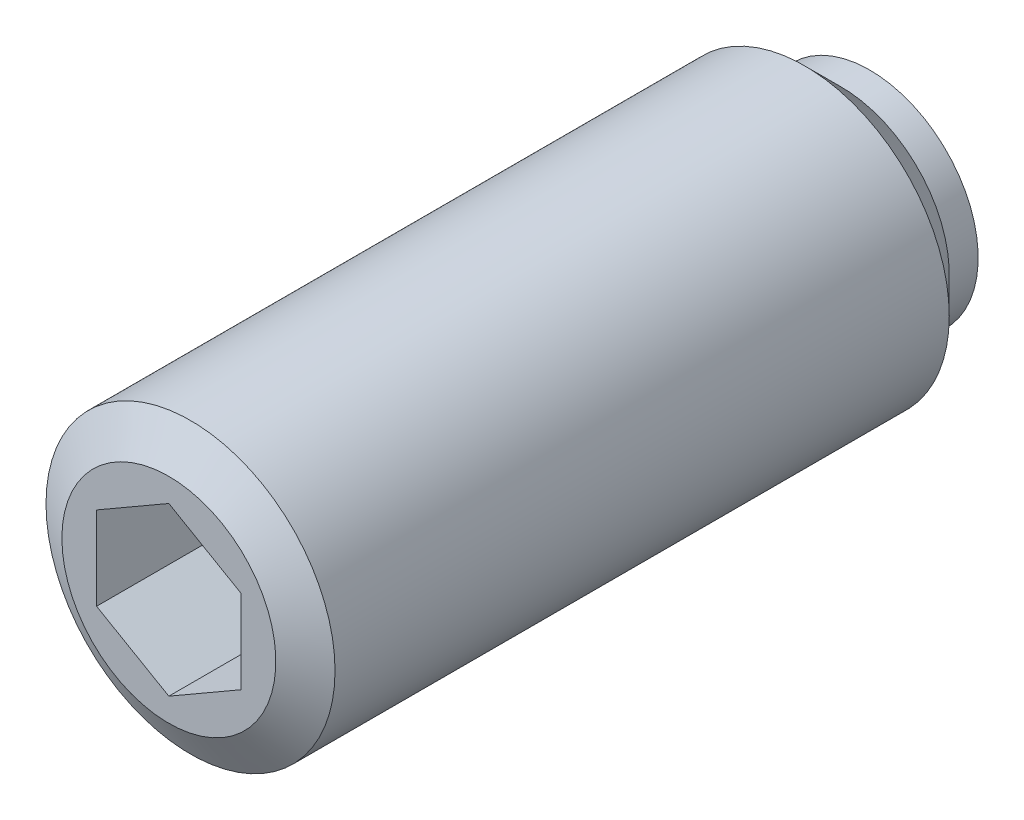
ISO-10303-21;
HEADER;
FILE_DESCRIPTION(('STEP AP214'),'2;1');
FILE_NAME('part.step','',(''),(''),'','','');
FILE_SCHEMA(('AUTOMOTIVE_DESIGN { 1 0 10303 214 1 1 1 1 }'));
ENDSEC;
DATA;
#1=APPLICATION_CONTEXT('core data for automotive mechanical design processes');
#2=APPLICATION_PROTOCOL_DEFINITION('international standard','automotive_design',2000,#1);
#3=PRODUCT_CONTEXT('',#1,'mechanical');
#4=PRODUCT('Part','Part','',(#3));
#5=PRODUCT_RELATED_PRODUCT_CATEGORY('part','',(#4));
#6=PRODUCT_DEFINITION_FORMATION('','',#4);
#7=PRODUCT_DEFINITION_CONTEXT('part definition',#1,'design');
#8=PRODUCT_DEFINITION('design','',#6,#7);
#9=PRODUCT_DEFINITION_SHAPE('','',#8);
#10=(LENGTH_UNIT() NAMED_UNIT(*) SI_UNIT(.MILLI.,.METRE.));
#11=(NAMED_UNIT(*) PLANE_ANGLE_UNIT() SI_UNIT($,.RADIAN.));
#12=(NAMED_UNIT(*) SI_UNIT($,.STERADIAN.) SOLID_ANGLE_UNIT());
#13=UNCERTAINTY_MEASURE_WITH_UNIT(LENGTH_MEASURE(1.E-05),#10,'distance_accuracy_value','');
#14=(GEOMETRIC_REPRESENTATION_CONTEXT(3) GLOBAL_UNCERTAINTY_ASSIGNED_CONTEXT((#13)) GLOBAL_UNIT_ASSIGNED_CONTEXT((#10,
#11,#12)) REPRESENTATION_CONTEXT('',''));
#15=CARTESIAN_POINT('',(0.,0.,0.));
#16=DIRECTION('',(0.,0.,1.));
#17=DIRECTION('',(1.,0.,0.));
#18=AXIS2_PLACEMENT_3D('',#15,#16,#17);
#19=CARTESIAN_POINT('',(0.,0.940733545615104,0.));
#20=DIRECTION('',(0.,0.,1.));
#21=DIRECTION('',(-1.,0.,0.));
#22=AXIS2_PLACEMENT_3D('',#19,#20,#21);
#23=PLANE('',#22);
#24=CARTESIAN_POINT('',(0.,0.,0.));
#25=DIRECTION('',(0.,0.,1.));
#26=DIRECTION('',(-1.,0.,0.));
#27=AXIS2_PLACEMENT_3D('',#24,#25,#26);
#28=CIRCLE('',#27,0.940733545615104);
#29=CARTESIAN_POINT('',(0.,0.9407335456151,0.));
#30=VERTEX_POINT('',#29);
#31=EDGE_CURVE('E9',#30,#30,#28,.T.);
#32=ORIENTED_EDGE('',*,*,#31,.F.);
#33=EDGE_LOOP('',(#32));
#34=FACE_BOUND('',#33,.T.);
#35=ADVANCED_FACE('F14',(#34),#23,.F.);
#36=CARTESIAN_POINT('',(0.,0.,0.823116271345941));
#37=DIRECTION('',(0.,0.,1.));
#38=DIRECTION('',(0.,1.,0.));
#39=AXIS2_PLACEMENT_3D('',#36,#37,#38);
#40=SPHERICAL_SURFACE('',#39,1.25);
#41=CARTESIAN_POINT('',(0.,0.,0.2));
#42=DIRECTION('',(0.,0.,1.));
#43=DIRECTION('',(-1.,0.,0.));
#44=AXIS2_PLACEMENT_3D('',#41,#42,#43);
#45=CIRCLE('',#44,1.0836171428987);
#46=CARTESIAN_POINT('',(0.,1.0836171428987,0.2));
#47=VERTEX_POINT('',#46);
#48=EDGE_CURVE('E21',#47,#47,#45,.T.);
#49=CARTESIAN_POINT('',(0.,1.0836171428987,0.2));
#50=CARTESIAN_POINT('',(0.,1.08233874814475,0.197776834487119));
#51=CARTESIAN_POINT('',(0.,1.08105351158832,0.1955576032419));
#52=CARTESIAN_POINT('',(0.,1.0784694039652,0.191127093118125));
#53=CARTESIAN_POINT('',(0.,1.0771705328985,0.188915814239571));
#54=CARTESIAN_POINT('',(0.,1.07455920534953,0.184501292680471));
#55=CARTESIAN_POINT('',(0.,1.07324674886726,0.182298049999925));
#56=CARTESIAN_POINT('',(0.,1.07060830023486,0.177899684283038));
#57=CARTESIAN_POINT('',(0.,1.06928230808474,0.175704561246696));
#58=CARTESIAN_POINT('',(0.,1.06661683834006,0.171322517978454));
#59=CARTESIAN_POINT('',(0.,1.0652773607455,0.169135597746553));
#60=CARTESIAN_POINT('',(0.,1.06258497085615,0.164770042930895));
#61=CARTESIAN_POINT('',(0.,1.06123205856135,0.162591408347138));
#62=CARTESIAN_POINT('',(0.,1.05851285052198,0.158242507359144));
#63=CARTESIAN_POINT('',(0.,1.05714655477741,0.156072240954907));
#64=CARTESIAN_POINT('',(0.,1.05440063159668,0.151740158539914));
#65=CARTESIAN_POINT('',(0.,1.05302100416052,0.149578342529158));
#66=CARTESIAN_POINT('',(0.,1.05024846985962,0.145263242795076));
#67=CARTESIAN_POINT('',(0.,1.04885556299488,0.143109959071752));
#68=CARTESIAN_POINT('',(0.,1.04605652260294,0.138812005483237));
#69=CARTESIAN_POINT('',(0.,1.04465038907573,0.136667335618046));
#70=CARTESIAN_POINT('',(0.,1.04182494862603,0.132386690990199));
#71=CARTESIAN_POINT('',(0.,1.04040564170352,0.130250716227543));
#72=CARTESIAN_POINT('',(0.,1.0375539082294,0.125987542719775));
#73=CARTESIAN_POINT('',(0.,1.03612148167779,0.123860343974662));
#74=CARTESIAN_POINT('',(0.,1.03324356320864,0.119614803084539));
#75=CARTESIAN_POINT('',(0.,1.03179807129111,0.117496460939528));
#76=CARTESIAN_POINT('',(0.,1.02889407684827,0.113268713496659));
#77=CARTESIAN_POINT('',(0.,1.02743557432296,0.1111593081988));
#78=CARTESIAN_POINT('',(0.,1.02450561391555,0.106949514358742));
#79=CARTESIAN_POINT('',(0.,1.02303415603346,0.104849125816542));
#80=CARTESIAN_POINT('',(0.,1.02007834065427,0.100657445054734));
#81=CARTESIAN_POINT('',(0.,1.01859398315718,0.0985661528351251));
#82=CARTESIAN_POINT('',(0.,1.01561242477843,0.094392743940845));
#83=CARTESIAN_POINT('',(0.,1.01411522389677,0.0923106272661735));
#84=CARTESIAN_POINT('',(0.,1.01110803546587,0.0881556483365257));
#85=CARTESIAN_POINT('',(0.,1.00959804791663,0.0860827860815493));
#86=CARTESIAN_POINT('',(0.,1.00656534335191,0.0819463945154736));
#87=CARTESIAN_POINT('',(0.,1.00504262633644,0.0798828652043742));
#88=CARTESIAN_POINT('',(0.,1.00198452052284,0.0757652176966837));
#89=CARTESIAN_POINT('',(0.,1.00044913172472,0.0737110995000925));
#90=CARTESIAN_POINT('',(0.,0.99736574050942,0.0696123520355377));
#91=CARTESIAN_POINT('',(0.,0.995817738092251,0.0675677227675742));
#92=CARTESIAN_POINT('',(0.,0.992709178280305,0.0634880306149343));
#93=CARTESIAN_POINT('',(0.,0.99114862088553,0.061452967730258));
#94=CARTESIAN_POINT('',(0.,0.988015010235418,0.0573924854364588));
#95=CARTESIAN_POINT('',(0.,0.986441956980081,0.055367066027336));
#96=CARTESIAN_POINT('',(0.,0.983283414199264,0.0513259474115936));
#97=CARTESIAN_POINT('',(0.,0.981697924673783,0.049310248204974));
#98=CARTESIAN_POINT('',(0.,0.978514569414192,0.0452886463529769));
#99=CARTESIAN_POINT('',(0.,0.976916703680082,0.0432827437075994));
#100=CARTESIAN_POINT('',(0.,0.973708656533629,0.0392808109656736));
#101=CARTESIAN_POINT('',(0.,0.972098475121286,0.0372847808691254));
#102=CARTESIAN_POINT('',(0.,0.968865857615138,0.0333026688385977));
#103=CARTESIAN_POINT('',(0.,0.967243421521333,0.0313165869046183));
#104=CARTESIAN_POINT('',(0.,0.963986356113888,0.0273544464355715));
#105=CARTESIAN_POINT('',(0.,0.962351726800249,0.0253783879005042));
#106=CARTESIAN_POINT('',(0.,0.959070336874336,0.0214363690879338));
#107=CARTESIAN_POINT('',(0.,0.957423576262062,0.0194704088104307));
#108=CARTESIAN_POINT('',(0.,0.95411798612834,0.0155486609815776));
#109=CARTESIAN_POINT('',(0.,0.952459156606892,0.0135928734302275));
#110=CARTESIAN_POINT('',(0.,0.949129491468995,0.00969154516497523));
#111=CARTESIAN_POINT('',(0.,0.947458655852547,0.00774600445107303));
#112=CARTESIAN_POINT('',(0.,0.944105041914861,0.00386524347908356));
#113=CARTESIAN_POINT('',(0.,0.942422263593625,0.00193002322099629));
#114=CARTESIAN_POINT('',(0.,0.9407335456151,0.));
#115=B_SPLINE_CURVE_WITH_KNOTS('',3,(#49,#50,#51,#52,#53,#54,#55,#56,#57,#58,#59,#60,#61,#62,
#63,#64,#65,#66,#67,#68,#69,#70,#71,#72,#73,#74,#75,#76,#77,#78,#79,#80,#81,#82,#83,#84,#85,#86,
#87,#88,#89,#90,#91,#92,#93,#94,#95,#96,#97,#98,#99,#100,#101,#102,#103,#104,#105,#106,#107,
#108,#109,#110,#111,#112,#113,#114),.UNSPECIFIED.,.F.,.F.,(4,2,2,2,2,2,2,2,2,2,2,2,2,2,2,2,2,2,
2,2,2,2,2,2,2,2,2,2,2,2,2,2,4),(0.,0.00769354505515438,0.0153870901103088,0.0230806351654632,
0.0307741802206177,0.0384677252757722,0.0461612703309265,0.0538548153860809,0.0615483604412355,
0.0692419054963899,0.0769354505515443,0.0846289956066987,0.092322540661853,0.100016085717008,
0.107709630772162,0.115403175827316,0.123096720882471,0.130790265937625,0.13848381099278,
0.146177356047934,0.153870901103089,0.161564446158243,0.169257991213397,0.176951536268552,
0.184645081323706,0.192338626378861,0.200032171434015,0.207725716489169,0.215419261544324,
0.223112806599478,0.230806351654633,0.238499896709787,0.246193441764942),.UNSPECIFIED.);
#116=EDGE_CURVE('BSEAM141',#47,#30,#115,.T.);
#117=ORIENTED_EDGE('',*,*,#48,.F.);
#118=ORIENTED_EDGE('',*,*,#31,.T.);
#119=ORIENTED_EDGE('',*,*,#116,.T.);
#120=ORIENTED_EDGE('',*,*,#116,.F.);
#121=EDGE_LOOP('',(#117,#119,#118,#120));
#122=FACE_BOUND('',#121,.T.);
#123=ADVANCED_FACE('F141',(#122),#40,.T.);
#124=CARTESIAN_POINT('',(0.,1.5,0.2));
#125=DIRECTION('',(0.,0.,1.));
#126=DIRECTION('',(-1.,0.,0.));
#127=AXIS2_PLACEMENT_3D('',#124,#125,#126);
#128=PLANE('',#127);
#129=CARTESIAN_POINT('',(0.,0.,0.2));
#130=DIRECTION('',(0.,0.,1.));
#131=DIRECTION('',(-1.,0.,0.));
#132=AXIS2_PLACEMENT_3D('',#129,#130,#131);
#133=CIRCLE('',#132,1.5);
#134=CARTESIAN_POINT('',(-1.5,0.,0.2));
#135=VERTEX_POINT('',#134);
#136=EDGE_CURVE('E134',#135,#135,#133,.T.);
#137=ORIENTED_EDGE('',*,*,#136,.F.);
#138=EDGE_LOOP('',(#137));
#139=FACE_BOUND('',#138,.T.);
#140=ORIENTED_EDGE('',*,*,#48,.T.);
#141=EDGE_LOOP('',(#140));
#142=FACE_BOUND('',#141,.T.);
#143=ADVANCED_FACE('F139',(#139,#142),#128,.F.);
#144=CARTESIAN_POINT('',(0.,0.,11.2950749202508));
#145=DIRECTION('',(0.,0.,1.));
#146=DIRECTION('',(-1.,0.,0.));
#147=AXIS2_PLACEMENT_3D('',#144,#145,#146);
#148=CYLINDRICAL_SURFACE('',#147,1.5);
#149=CARTESIAN_POINT('',(0.,0.,0.6));
#150=DIRECTION('',(0.,0.,1.));
#151=DIRECTION('',(-1.,0.,0.));
#152=AXIS2_PLACEMENT_3D('',#149,#150,#151);
#153=CIRCLE('',#152,1.5);
#154=CARTESIAN_POINT('',(-1.5,0.,0.6));
#155=VERTEX_POINT('',#154);
#156=EDGE_CURVE('E131',#155,#155,#153,.T.);
#157=ORIENTED_EDGE('',*,*,#156,.F.);
#158=EDGE_LOOP('',(#157));
#159=FACE_BOUND('',#158,.T.);
#160=ORIENTED_EDGE('',*,*,#136,.T.);
#161=EDGE_LOOP('',(#160));
#162=FACE_BOUND('',#161,.T.);
#163=ADVANCED_FACE('F164',(#159,#162),#148,.T.);
#164=CARTESIAN_POINT('',(0.,0.,0.6));
#165=DIRECTION('',(0.,0.,1.));
#166=DIRECTION('',(-1.,0.,0.));
#167=AXIS2_PLACEMENT_3D('',#164,#165,#166);
#168=CONICAL_SURFACE('',#167,1.5,0.785398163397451);
#169=CARTESIAN_POINT('',(0.,0.,1.1));
#170=DIRECTION('',(0.,0.,1.));
#171=DIRECTION('',(-1.,0.,0.));
#172=AXIS2_PLACEMENT_3D('',#169,#170,#171);
#173=CIRCLE('',#172,2.);
#174=CARTESIAN_POINT('',(-2.,0.,1.1));
#175=VERTEX_POINT('',#174);
#176=EDGE_CURVE('E128',#175,#175,#173,.T.);
#177=ORIENTED_EDGE('',*,*,#176,.F.);
#178=EDGE_LOOP('',(#177));
#179=FACE_BOUND('',#178,.T.);
#180=ORIENTED_EDGE('',*,*,#156,.T.);
#181=EDGE_LOOP('',(#180));
#182=FACE_BOUND('',#181,.T.);
#183=ADVANCED_FACE('F173',(#179,#182),#168,.T.);
#184=CARTESIAN_POINT('',(0.,0.,11.2950749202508));
#185=DIRECTION('',(0.,0.,1.));
#186=DIRECTION('',(-1.,0.,0.));
#187=AXIS2_PLACEMENT_3D('',#184,#185,#186);
#188=CYLINDRICAL_SURFACE('',#187,2.);
#189=CARTESIAN_POINT('',(0.,0.,9.6));
#190=DIRECTION('',(0.,0.,1.));
#191=DIRECTION('',(-1.,0.,0.));
#192=AXIS2_PLACEMENT_3D('',#189,#190,#191);
#193=CIRCLE('',#192,2.);
#194=CARTESIAN_POINT('',(-2.,0.,9.6));
#195=VERTEX_POINT('',#194);
#196=EDGE_CURVE('E125',#195,#195,#193,.T.);
#197=ORIENTED_EDGE('',*,*,#196,.F.);
#198=EDGE_LOOP('',(#197));
#199=FACE_BOUND('',#198,.T.);
#200=ORIENTED_EDGE('',*,*,#176,.T.);
#201=EDGE_LOOP('',(#200));
#202=FACE_BOUND('',#201,.T.);
#203=ADVANCED_FACE('F182',(#199,#202),#188,.T.);
#204=CARTESIAN_POINT('',(0.,0.,9.6));
#205=DIRECTION('',(0.,0.,-1.));
#206=DIRECTION('',(1.,0.,0.));
#207=AXIS2_PLACEMENT_3D('',#204,#205,#206);
#208=CONICAL_SURFACE('',#207,2.,1.04719755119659);
#209=CARTESIAN_POINT('',(0.,0.,9.9));
#210=DIRECTION('',(0.,0.,1.));
#211=DIRECTION('',(-1.,0.,0.));
#212=AXIS2_PLACEMENT_3D('',#209,#210,#211);
#213=CIRCLE('',#212,1.48038475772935);
#214=CARTESIAN_POINT('',(-1.48038475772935,0.,9.9));
#215=VERTEX_POINT('',#214);
#216=EDGE_CURVE('E116',#215,#215,#213,.T.);
#217=ORIENTED_EDGE('',*,*,#216,.F.);
#218=EDGE_LOOP('',(#217));
#219=FACE_BOUND('',#218,.T.);
#220=ORIENTED_EDGE('',*,*,#196,.T.);
#221=EDGE_LOOP('',(#220));
#222=FACE_BOUND('',#221,.T.);
#223=ADVANCED_FACE('F191',(#219,#222),#208,.T.);
#224=CARTESIAN_POINT('',(0.,0.,9.9));
#225=DIRECTION('',(0.,0.,-1.));
#226=DIRECTION('',(1.,0.,0.));
#227=AXIS2_PLACEMENT_3D('',#224,#225,#226);
#228=PLANE('',#227);
#229=DIRECTION('',(-0.866025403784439,-0.5,0.));
#230=VECTOR('',#229,1.);
#231=CARTESIAN_POINT('',(0.,1.15470053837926,9.9));
#232=LINE('',#231,#230);
#233=CARTESIAN_POINT('',(0.,1.15470053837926,9.9));
#234=VERTEX_POINT('',#233);
#235=CARTESIAN_POINT('',(-1.,0.577350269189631,9.9));
#236=VERTEX_POINT('',#235);
#237=EDGE_CURVE('E82',#234,#236,#232,.T.);
#238=ORIENTED_EDGE('',*,*,#237,.F.);
#239=DIRECTION('',(-0.866025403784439,0.5,0.));
#240=VECTOR('',#239,1.);
#241=CARTESIAN_POINT('',(1.,0.577350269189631,9.9));
#242=LINE('',#241,#240);
#243=CARTESIAN_POINT('',(1.,0.577350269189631,9.9));
#244=VERTEX_POINT('',#243);
#245=EDGE_CURVE('E28',#244,#234,#242,.T.);
#246=ORIENTED_EDGE('',*,*,#245,.F.);
#247=DIRECTION('',(0.,1.,0.));
#248=VECTOR('',#247,1.);
#249=CARTESIAN_POINT('',(1.,-0.577350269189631,9.9));
#250=LINE('',#249,#248);
#251=CARTESIAN_POINT('',(1.,-0.577350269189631,9.9));
#252=VERTEX_POINT('',#251);
#253=EDGE_CURVE('E98',#252,#244,#250,.T.);
#254=ORIENTED_EDGE('',*,*,#253,.F.);
#255=DIRECTION('',(0.866025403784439,0.5,0.));
#256=VECTOR('',#255,1.);
#257=CARTESIAN_POINT('',(0.,-1.15470053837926,9.9));
#258=LINE('',#257,#256);
#259=CARTESIAN_POINT('',(0.,-1.15470053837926,9.9));
#260=VERTEX_POINT('',#259);
#261=EDGE_CURVE('E92',#260,#252,#258,.T.);
#262=ORIENTED_EDGE('',*,*,#261,.F.);
#263=DIRECTION('',(0.866025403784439,-0.5,0.));
#264=VECTOR('',#263,1.);
#265=CARTESIAN_POINT('',(-1.,-0.577350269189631,9.9));
#266=LINE('',#265,#264);
#267=CARTESIAN_POINT('',(-1.,-0.577350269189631,9.9));
#268=VERTEX_POINT('',#267);
#269=EDGE_CURVE('E90',#268,#260,#266,.T.);
#270=ORIENTED_EDGE('',*,*,#269,.F.);
#271=DIRECTION('',(0.,-1.,0.));
#272=VECTOR('',#271,1.);
#273=CARTESIAN_POINT('',(-1.,0.577350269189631,9.9));
#274=LINE('',#273,#272);
#275=EDGE_CURVE('E71',#236,#268,#274,.T.);
#276=ORIENTED_EDGE('',*,*,#275,.F.);
#277=EDGE_LOOP('',(#238,#246,#254,#262,#270,#276));
#278=FACE_BOUND('',#277,.T.);
#279=ORIENTED_EDGE('',*,*,#216,.T.);
#280=EDGE_LOOP('',(#279));
#281=FACE_BOUND('',#280,.T.);
#282=ADVANCED_FACE('F86',(#278,#281),#228,.F.);
#283=CARTESIAN_POINT('',(1.,0.577350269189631,7.9));
#284=DIRECTION('',(0.5,0.866025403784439,0.));
#285=DIRECTION('',(0.866025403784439,-0.5,0.));
#286=AXIS2_PLACEMENT_3D('',#283,#284,#285);
#287=PLANE('',#286);
#288=ORIENTED_EDGE('',*,*,#245,.T.);
#289=DIRECTION('',(0.,0.,1.));
#290=VECTOR('',#289,1.);
#291=CARTESIAN_POINT('',(0.,1.15470053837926,7.9));
#292=LINE('',#291,#290);
#293=CARTESIAN_POINT('',(0.,1.15470053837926,7.9));
#294=VERTEX_POINT('',#293);
#295=EDGE_CURVE('E79',#294,#234,#292,.T.);
#296=ORIENTED_EDGE('',*,*,#295,.F.);
#297=DIRECTION('',(-0.866025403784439,0.5,0.));
#298=VECTOR('',#297,1.);
#299=CARTESIAN_POINT('',(1.,0.577350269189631,7.9));
#300=LINE('',#299,#298);
#301=CARTESIAN_POINT('',(1.,0.577350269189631,7.9));
#302=VERTEX_POINT('',#301);
#303=EDGE_CURVE('E100',#302,#294,#300,.T.);
#304=ORIENTED_EDGE('',*,*,#303,.F.);
#305=DIRECTION('',(0.,0.,1.));
#306=VECTOR('',#305,1.);
#307=CARTESIAN_POINT('',(1.,0.577350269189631,7.9));
#308=LINE('',#307,#306);
#309=EDGE_CURVE('E35',#302,#244,#308,.T.);
#310=ORIENTED_EDGE('',*,*,#309,.T.);
#311=EDGE_LOOP('',(#288,#296,#304,#310));
#312=FACE_BOUND('',#311,.T.);
#313=ADVANCED_FACE('F208',(#312),#287,.F.);
#314=CARTESIAN_POINT('',(1.,-0.577350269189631,7.9));
#315=DIRECTION('',(1.,0.,0.));
#316=DIRECTION('',(0.,-1.,0.));
#317=AXIS2_PLACEMENT_3D('',#314,#315,#316);
#318=PLANE('',#317);
#319=ORIENTED_EDGE('',*,*,#253,.T.);
#320=ORIENTED_EDGE('',*,*,#309,.F.);
#321=DIRECTION('',(0.,1.,0.));
#322=VECTOR('',#321,1.);
#323=CARTESIAN_POINT('',(1.,-0.577350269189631,7.9));
#324=LINE('',#323,#322);
#325=CARTESIAN_POINT('',(1.,-0.577350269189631,7.9));
#326=VERTEX_POINT('',#325);
#327=EDGE_CURVE('E112',#326,#302,#324,.T.);
#328=ORIENTED_EDGE('',*,*,#327,.F.);
#329=DIRECTION('',(0.,0.,1.));
#330=VECTOR('',#329,1.);
#331=CARTESIAN_POINT('',(1.,-0.577350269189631,7.9));
#332=LINE('',#331,#330);
#333=EDGE_CURVE('E117',#326,#252,#332,.T.);
#334=ORIENTED_EDGE('',*,*,#333,.T.);
#335=EDGE_LOOP('',(#319,#320,#328,#334));
#336=FACE_BOUND('',#335,.T.);
#337=ADVANCED_FACE('F216',(#336),#318,.F.);
#338=CARTESIAN_POINT('',(0.,-1.15470053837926,7.9));
#339=DIRECTION('',(0.5,-0.866025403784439,0.));
#340=DIRECTION('',(-0.866025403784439,-0.5,0.));
#341=AXIS2_PLACEMENT_3D('',#338,#339,#340);
#342=PLANE('',#341);
#343=ORIENTED_EDGE('',*,*,#261,.T.);
#344=ORIENTED_EDGE('',*,*,#333,.F.);
#345=DIRECTION('',(0.866025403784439,0.5,0.));
#346=VECTOR('',#345,1.);
#347=CARTESIAN_POINT('',(0.,-1.15470053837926,7.9));
#348=LINE('',#347,#346);
#349=CARTESIAN_POINT('',(0.,-1.15470053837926,7.9));
#350=VERTEX_POINT('',#349);
#351=EDGE_CURVE('E109',#350,#326,#348,.T.);
#352=ORIENTED_EDGE('',*,*,#351,.F.);
#353=DIRECTION('',(0.,0.,1.));
#354=VECTOR('',#353,1.);
#355=CARTESIAN_POINT('',(0.,-1.15470053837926,7.9));
#356=LINE('',#355,#354);
#357=EDGE_CURVE('E119',#350,#260,#356,.T.);
#358=ORIENTED_EDGE('',*,*,#357,.T.);
#359=EDGE_LOOP('',(#343,#344,#352,#358));
#360=FACE_BOUND('',#359,.T.);
#361=ADVANCED_FACE('F224',(#360),#342,.F.);
#362=CARTESIAN_POINT('',(-1.,-0.577350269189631,7.9));
#363=DIRECTION('',(-0.5,-0.866025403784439,0.));
#364=DIRECTION('',(-0.866025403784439,0.5,0.));
#365=AXIS2_PLACEMENT_3D('',#362,#363,#364);
#366=PLANE('',#365);
#367=ORIENTED_EDGE('',*,*,#269,.T.);
#368=ORIENTED_EDGE('',*,*,#357,.F.);
#369=DIRECTION('',(0.866025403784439,-0.5,0.));
#370=VECTOR('',#369,1.);
#371=CARTESIAN_POINT('',(-1.,-0.577350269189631,7.9));
#372=LINE('',#371,#370);
#373=CARTESIAN_POINT('',(-1.,-0.577350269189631,7.9));
#374=VERTEX_POINT('',#373);
#375=EDGE_CURVE('E106',#374,#350,#372,.T.);
#376=ORIENTED_EDGE('',*,*,#375,.F.);
#377=DIRECTION('',(0.,0.,1.));
#378=VECTOR('',#377,1.);
#379=CARTESIAN_POINT('',(-1.,-0.577350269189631,7.9));
#380=LINE('',#379,#378);
#381=EDGE_CURVE('E78',#374,#268,#380,.T.);
#382=ORIENTED_EDGE('',*,*,#381,.T.);
#383=EDGE_LOOP('',(#367,#368,#376,#382));
#384=FACE_BOUND('',#383,.T.);
#385=ADVANCED_FACE('F232',(#384),#366,.F.);
#386=CARTESIAN_POINT('',(-1.,0.577350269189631,7.9));
#387=DIRECTION('',(-1.,0.,0.));
#388=DIRECTION('',(0.,0.,-1.));
#389=AXIS2_PLACEMENT_3D('',#386,#387,#388);
#390=PLANE('',#389);
#391=ORIENTED_EDGE('',*,*,#275,.T.);
#392=ORIENTED_EDGE('',*,*,#381,.F.);
#393=DIRECTION('',(0.,-1.,0.));
#394=VECTOR('',#393,1.);
#395=CARTESIAN_POINT('',(-1.,0.577350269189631,7.9));
#396=LINE('',#395,#394);
#397=CARTESIAN_POINT('',(-1.,0.577350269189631,7.9));
#398=VERTEX_POINT('',#397);
#399=EDGE_CURVE('E74',#398,#374,#396,.T.);
#400=ORIENTED_EDGE('',*,*,#399,.F.);
#401=DIRECTION('',(0.,0.,1.));
#402=VECTOR('',#401,1.);
#403=CARTESIAN_POINT('',(-1.,0.577350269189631,7.9));
#404=LINE('',#403,#402);
#405=EDGE_CURVE('E67',#398,#236,#404,.T.);
#406=ORIENTED_EDGE('',*,*,#405,.T.);
#407=EDGE_LOOP('',(#391,#392,#400,#406));
#408=FACE_BOUND('',#407,.T.);
#409=ADVANCED_FACE('F69',(#408),#390,.F.);
#410=CARTESIAN_POINT('',(0.,1.15470053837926,7.9));
#411=DIRECTION('',(-0.5,0.866025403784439,0.));
#412=DIRECTION('',(0.866025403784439,0.5,0.));
#413=AXIS2_PLACEMENT_3D('',#410,#411,#412);
#414=PLANE('',#413);
#415=ORIENTED_EDGE('',*,*,#237,.T.);
#416=ORIENTED_EDGE('',*,*,#405,.F.);
#417=DIRECTION('',(-0.866025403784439,-0.5,0.));
#418=VECTOR('',#417,1.);
#419=CARTESIAN_POINT('',(0.,1.15470053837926,7.9));
#420=LINE('',#419,#418);
#421=EDGE_CURVE('E103',#294,#398,#420,.T.);
#422=ORIENTED_EDGE('',*,*,#421,.F.);
#423=ORIENTED_EDGE('',*,*,#295,.T.);
#424=EDGE_LOOP('',(#415,#416,#422,#423));
#425=FACE_BOUND('',#424,.T.);
#426=ADVANCED_FACE('F83',(#425),#414,.F.);
#427=CARTESIAN_POINT('',(2.,0.,7.9));
#428=DIRECTION('',(0.,0.,-1.));
#429=DIRECTION('',(1.,0.,0.));
#430=AXIS2_PLACEMENT_3D('',#427,#428,#429);
#431=PLANE('',#430);
#432=ORIENTED_EDGE('',*,*,#303,.T.);
#433=ORIENTED_EDGE('',*,*,#421,.T.);
#434=ORIENTED_EDGE('',*,*,#399,.T.);
#435=ORIENTED_EDGE('',*,*,#375,.T.);
#436=ORIENTED_EDGE('',*,*,#351,.T.);
#437=ORIENTED_EDGE('',*,*,#327,.T.);
#438=EDGE_LOOP('',(#432,#433,#434,#435,#436,#437));
#439=FACE_BOUND('',#438,.T.);
#440=ADVANCED_FACE('F256',(#439),#431,.F.);
#441=CLOSED_SHELL('',(#35,#123,#143,#163,#183,#203,#223,#282,#313,#337,#361,#385,#409,#426,#440));
#442=MANIFOLD_SOLID_BREP('B1',#441);
#443=ADVANCED_BREP_SHAPE_REPRESENTATION('',(#18,#442),#14);
#444=SHAPE_DEFINITION_REPRESENTATION(#9,#443);
ENDSEC;
END-ISO-10303-21;
